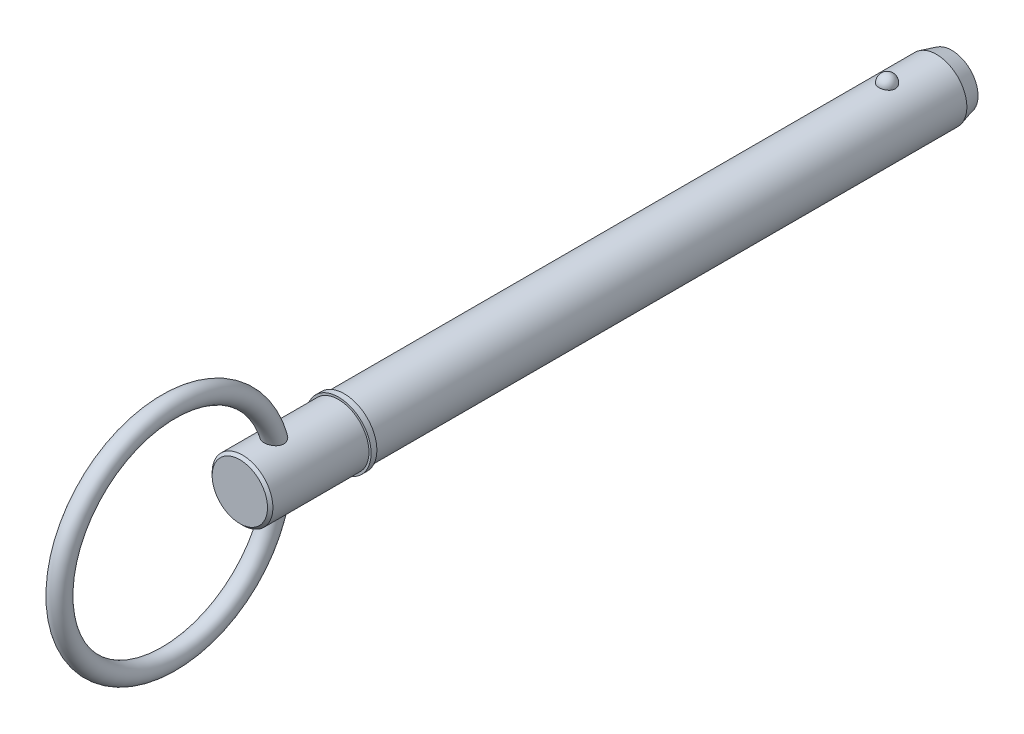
ISO-10303-21;
HEADER;
FILE_DESCRIPTION(('STEP AP214'),'2;1');
FILE_NAME('part.step','',(''),(''),'','','');
FILE_SCHEMA(('AUTOMOTIVE_DESIGN { 1 0 10303 214 1 1 1 1 }'));
ENDSEC;
DATA;
#1=APPLICATION_CONTEXT('core data for automotive mechanical design processes');
#2=APPLICATION_PROTOCOL_DEFINITION('international standard','automotive_design',2000,#1);
#3=PRODUCT_CONTEXT('',#1,'mechanical');
#4=PRODUCT('Part','Part','',(#3));
#5=PRODUCT_RELATED_PRODUCT_CATEGORY('part','',(#4));
#6=PRODUCT_DEFINITION_FORMATION('','',#4);
#7=PRODUCT_DEFINITION_CONTEXT('part definition',#1,'design');
#8=PRODUCT_DEFINITION('design','',#6,#7);
#9=PRODUCT_DEFINITION_SHAPE('','',#8);
#10=(LENGTH_UNIT() NAMED_UNIT(*) SI_UNIT(.MILLI.,.METRE.));
#11=(NAMED_UNIT(*) PLANE_ANGLE_UNIT() SI_UNIT($,.RADIAN.));
#12=(NAMED_UNIT(*) SI_UNIT($,.STERADIAN.) SOLID_ANGLE_UNIT());
#13=UNCERTAINTY_MEASURE_WITH_UNIT(LENGTH_MEASURE(1.E-05),#10,'distance_accuracy_value','');
#14=(GEOMETRIC_REPRESENTATION_CONTEXT(3) GLOBAL_UNCERTAINTY_ASSIGNED_CONTEXT((#13)) GLOBAL_UNIT_ASSIGNED_CONTEXT((#10,
#11,#12)) REPRESENTATION_CONTEXT('',''));
#15=CARTESIAN_POINT('',(0.,0.,0.));
#16=DIRECTION('',(0.,0.,1.));
#17=DIRECTION('',(1.,0.,0.));
#18=AXIS2_PLACEMENT_3D('',#15,#16,#17);
#19=CARTESIAN_POINT('',(0.,0.,139.7));
#20=DIRECTION('',(0.,0.,-1.));
#21=DIRECTION('',(-1.,0.,0.));
#22=AXIS2_PLACEMENT_3D('',#19,#20,#21);
#23=CYLINDRICAL_SURFACE('',#22,7.94);
#24=CARTESIAN_POINT('',(2.13020349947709,7.64891057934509,-2.14999999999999));
#25=CARTESIAN_POINT('',(2.1302012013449,7.64891247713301,-2.02978166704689));
#26=CARTESIAN_POINT('',(2.12037546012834,7.65166842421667,-1.90953383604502));
#27=CARTESIAN_POINT('',(2.08130792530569,7.66238579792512,-1.67243962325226));
#28=CARTESIAN_POINT('',(2.05205785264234,7.67034944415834,-1.55559471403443));
#29=CARTESIAN_POINT('',(1.97489181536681,7.69057749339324,-1.32869361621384));
#30=CARTESIAN_POINT('',(1.92698409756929,7.70283999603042,-1.21863445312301));
#31=CARTESIAN_POINT('',(1.81370645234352,7.73029430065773,-1.00831338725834));
#32=CARTESIAN_POINT('',(1.74833715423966,7.7454859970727,-0.908051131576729));
#33=CARTESIAN_POINT('',(1.60144242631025,7.77718699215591,-0.719628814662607));
#34=CARTESIAN_POINT('',(1.51984382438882,7.7937020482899,-0.631526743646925));
#35=CARTESIAN_POINT('',(1.34279837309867,7.82614685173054,-0.470411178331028));
#36=CARTESIAN_POINT('',(1.24735148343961,7.84207659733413,-0.397397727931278));
#37=CARTESIAN_POINT('',(1.04544839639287,7.87153116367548,-0.268681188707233));
#38=CARTESIAN_POINT('',(0.939022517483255,7.88506234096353,-0.212932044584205));
#39=CARTESIAN_POINT('',(0.717931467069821,7.90825597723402,-0.120080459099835));
#40=CARTESIAN_POINT('',(0.603267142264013,7.9179188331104,-0.0829761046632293));
#41=CARTESIAN_POINT('',(0.371015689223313,7.93216561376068,-0.0289596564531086));
#42=CARTESIAN_POINT('',(0.253510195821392,7.93683225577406,-0.0117183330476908));
#43=CARTESIAN_POINT('',(0.0171784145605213,7.94086051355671,0.00318921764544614));
#44=CARTESIAN_POINT('',(-0.101647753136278,7.94022260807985,0.000857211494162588));
#45=CARTESIAN_POINT('',(-0.335567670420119,7.93375751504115,-0.023146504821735));
#46=CARTESIAN_POINT('',(-0.450690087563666,7.92799987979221,-0.0445590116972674));
#47=CARTESIAN_POINT('',(-0.675610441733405,7.91200792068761,-0.10576054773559));
#48=CARTESIAN_POINT('',(-0.785408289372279,7.90177352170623,-0.145549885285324));
#49=CARTESIAN_POINT('',(-0.9972706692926,7.87784802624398,-0.242675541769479));
#50=CARTESIAN_POINT('',(-1.0992893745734,7.86413823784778,-0.300107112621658));
#51=CARTESIAN_POINT('',(-1.29223659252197,7.83474718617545,-0.430887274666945));
#52=CARTESIAN_POINT('',(-1.38316404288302,7.81906573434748,-0.504237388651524));
#53=CARTESIAN_POINT('',(-1.55313516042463,7.78710451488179,-0.666358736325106));
#54=CARTESIAN_POINT('',(-1.63193689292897,7.77081906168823,-0.755382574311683));
#55=CARTESIAN_POINT('',(-1.77366356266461,7.73970270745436,-0.945507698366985));
#56=CARTESIAN_POINT('',(-1.83658745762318,7.72487190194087,-1.04660977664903));
#57=CARTESIAN_POINT('',(-1.94556640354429,7.6981535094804,-1.25927689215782));
#58=CARTESIAN_POINT('',(-1.99143480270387,7.6862989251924,-1.3709418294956));
#59=CARTESIAN_POINT('',(-2.06418311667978,7.66708387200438,-1.60066153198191));
#60=CARTESIAN_POINT('',(-2.0910635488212,7.65972328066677,-1.71871612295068));
#61=CARTESIAN_POINT('',(-2.12508507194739,7.65035479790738,-1.9573607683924));
#62=CARTESIAN_POINT('',(-2.13230490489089,7.64832555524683,-2.07793875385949));
#63=CARTESIAN_POINT('',(-2.12704767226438,7.64978921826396,-2.31862835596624));
#64=CARTESIAN_POINT('',(-2.1145710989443,7.6532819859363,-2.43873998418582));
#65=CARTESIAN_POINT('',(-2.07034166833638,7.66536368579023,-2.67451689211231));
#66=CARTESIAN_POINT('',(-2.03867758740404,7.67392914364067,-2.79020005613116));
#67=CARTESIAN_POINT('',(-1.95694065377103,7.69517736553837,-3.01446692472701));
#68=CARTESIAN_POINT('',(-1.90686710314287,7.70786028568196,-3.12305035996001));
#69=CARTESIAN_POINT('',(-1.78925555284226,7.73600831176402,-3.33065971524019));
#70=CARTESIAN_POINT('',(-1.72162904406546,7.75148739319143,-3.42963360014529));
#71=CARTESIAN_POINT('',(-1.57074739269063,7.78346215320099,-3.61466914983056));
#72=CARTESIAN_POINT('',(-1.48749169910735,7.79995786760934,-3.70073035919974));
#73=CARTESIAN_POINT('',(-1.30720250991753,7.83219119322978,-3.8578359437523));
#74=CARTESIAN_POINT('',(-1.2101234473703,7.84792605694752,-3.92882863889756));
#75=CARTESIAN_POINT('',(-1.00503150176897,7.87681523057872,-4.05342383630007));
#76=CARTESIAN_POINT('',(-0.897019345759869,7.88996971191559,-4.10702749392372));
#77=CARTESIAN_POINT('',(-0.674439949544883,7.91208451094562,-4.19477736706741));
#78=CARTESIAN_POINT('',(-0.55996501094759,7.92109245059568,-4.22914554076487));
#79=CARTESIAN_POINT('',(-0.326625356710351,7.93413878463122,-4.27838865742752));
#80=CARTESIAN_POINT('',(-0.20776113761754,7.93817773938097,-4.29326579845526));
#81=CARTESIAN_POINT('',(0.0287357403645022,7.94081322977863,-4.3030062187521));
#82=CARTESIAN_POINT('',(0.14635312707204,7.93950453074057,-4.29821797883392));
#83=CARTESIAN_POINT('',(0.379062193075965,7.93180098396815,-4.26955229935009));
#84=CARTESIAN_POINT('',(0.494153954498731,7.92540630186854,-4.24567548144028));
#85=CARTESIAN_POINT('',(0.718185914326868,7.90824874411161,-4.17962260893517));
#86=CARTESIAN_POINT('',(0.827145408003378,7.89750055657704,-4.13750805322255));
#87=CARTESIAN_POINT('',(1.03638036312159,7.87277755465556,-4.03615078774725));
#88=CARTESIAN_POINT('',(1.13665531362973,7.85880255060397,-3.97690707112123));
#89=CARTESIAN_POINT('',(1.32729731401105,7.82887859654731,-3.84189297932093));
#90=CARTESIAN_POINT('',(1.41749828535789,7.81290379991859,-3.76589388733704));
#91=CARTESIAN_POINT('',(1.58397257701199,7.78086330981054,-3.59992466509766));
#92=CARTESIAN_POINT('',(1.66024342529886,7.76479760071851,-3.50995206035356));
#93=CARTESIAN_POINT('',(1.79805631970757,7.73405928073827,-3.3168832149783));
#94=CARTESIAN_POINT('',(1.85933944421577,7.719413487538,-3.213597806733));
#95=CARTESIAN_POINT('',(1.96397499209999,7.69345992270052,-2.99796163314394));
#96=CARTESIAN_POINT('',(2.00733488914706,7.68215076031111,-2.88561466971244));
#97=CARTESIAN_POINT('',(2.07068045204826,7.66529896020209,-2.6699413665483));
#98=CARTESIAN_POINT('',(2.09296296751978,7.65919990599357,-2.56732606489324));
#99=CARTESIAN_POINT('',(2.12272535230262,7.65100492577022,-2.35981463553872));
#100=CARTESIAN_POINT('',(2.13020550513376,7.64890892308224,-2.25491855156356));
#101=CARTESIAN_POINT('',(2.13020349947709,7.64891057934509,-2.14999999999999));
#102=B_SPLINE_CURVE_WITH_KNOTS('',3,(#24,#25,#26,#27,#28,#29,#30,#31,#32,#33,#34,#35,#36,#37,
#38,#39,#40,#41,#42,#43,#44,#45,#46,#47,#48,#49,#50,#51,#52,#53,#54,#55,#56,#57,#58,#59,#60,#61,
#62,#63,#64,#65,#66,#67,#68,#69,#70,#71,#72,#73,#74,#75,#76,#77,#78,#79,#80,#81,#82,#83,#84,#85,
#86,#87,#88,#89,#90,#91,#92,#93,#94,#95,#96,#97,#98,#99,#100,#101),.UNSPECIFIED.,.T.,.F.,(4,2,2,
2,2,2,2,2,2,2,2,2,2,2,2,2,2,2,2,2,2,2,2,2,2,2,2,2,2,2,2,2,2,2,2,2,2,2,4),(0.,0.360277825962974,
0.720709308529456,1.0809816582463,1.44124102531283,1.80316307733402,2.16508618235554,
2.52603531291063,2.88694740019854,3.24178717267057,3.59659491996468,3.94665496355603,
4.29672088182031,4.64871108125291,5.0007349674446,5.3590619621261,5.71741247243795,
6.079576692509,6.44173104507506,6.80243279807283,7.16312553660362,7.52216203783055,
7.88121215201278,8.24210915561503,8.60301888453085,8.96514709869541,9.32725124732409,
9.68508606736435,10.0428805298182,10.3943622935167,10.7458326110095,11.0961268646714,
11.4464417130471,11.8018724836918,12.1573662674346,12.5186252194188,12.8797333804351,
13.1941658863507,13.5085923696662),.UNSPECIFIED.);
#103=CARTESIAN_POINT('',(2.13020349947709,7.64891057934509,-2.14999999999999));
#104=VERTEX_POINT('',#103);
#105=EDGE_CURVE('E102',#104,#104,#102,.T.);
#106=ORIENTED_EDGE('',*,*,#105,.T.);
#107=EDGE_LOOP('',(#106));
#108=FACE_BOUND('',#107,.T.);
#109=CARTESIAN_POINT('',(0.,0.,-15.05));
#110=DIRECTION('',(0.,0.,-1.));
#111=DIRECTION('',(-1.,0.,0.));
#112=AXIS2_PLACEMENT_3D('',#109,#110,#111);
#113=CIRCLE('',#112,7.94);
#114=CARTESIAN_POINT('',(-7.94,0.,-15.05));
#115=VERTEX_POINT('',#114);
#116=EDGE_CURVE('E109',#115,#115,#113,.F.);
#117=ORIENTED_EDGE('',*,*,#116,.T.);
#118=EDGE_LOOP('',(#117));
#119=FACE_BOUND('',#118,.T.);
#120=CARTESIAN_POINT('',(0.,0.,139.7));
#121=DIRECTION('',(0.,0.,1.));
#122=DIRECTION('',(1.,0.,0.));
#123=AXIS2_PLACEMENT_3D('',#120,#121,#122);
#124=CIRCLE('',#123,7.94);
#125=CARTESIAN_POINT('',(7.94,0.,139.7));
#126=VERTEX_POINT('',#125);
#127=EDGE_CURVE('E107',#126,#126,#124,.T.);
#128=ORIENTED_EDGE('',*,*,#127,.F.);
#129=EDGE_LOOP('',(#128));
#130=FACE_BOUND('',#129,.T.);
#131=ADVANCED_FACE('F39',(#108,#119,#130),#23,.T.);
#132=CARTESIAN_POINT('',(0.,0.,-19.05));
#133=DIRECTION('',(0.,0.,-1.));
#134=DIRECTION('',(-1.,0.,0.));
#135=AXIS2_PLACEMENT_3D('',#132,#133,#134);
#136=PLANE('',#135);
#137=CARTESIAN_POINT('',(0.,0.,-19.05));
#138=DIRECTION('',(0.,0.,-1.));
#139=DIRECTION('',(-1.,0.,0.));
#140=AXIS2_PLACEMENT_3D('',#137,#138,#139);
#141=CIRCLE('',#140,6.86820323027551);
#142=CARTESIAN_POINT('',(-6.86820323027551,0.,-19.05));
#143=VERTEX_POINT('',#142);
#144=EDGE_CURVE('E141',#143,#143,#141,.T.);
#145=ORIENTED_EDGE('',*,*,#144,.T.);
#146=EDGE_LOOP('',(#145));
#147=FACE_BOUND('',#146,.T.);
#148=ADVANCED_FACE('F88',(#147),#136,.T.);
#149=CARTESIAN_POINT('',(0.,0.,-19.05));
#150=DIRECTION('',(0.,0.,1.));
#151=DIRECTION('',(1.,0.,0.));
#152=AXIS2_PLACEMENT_3D('',#149,#150,#151);
#153=CONICAL_SURFACE('',#152,6.8682032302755,0.261799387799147);
#154=ORIENTED_EDGE('',*,*,#116,.F.);
#155=EDGE_LOOP('',(#154));
#156=FACE_BOUND('',#155,.T.);
#157=ORIENTED_EDGE('',*,*,#144,.F.);
#158=EDGE_LOOP('',(#157));
#159=FACE_BOUND('',#158,.T.);
#160=ADVANCED_FACE('F94',(#156,#159),#153,.T.);
#161=CARTESIAN_POINT('',(0.,7.94,-2.14999999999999));
#162=DIRECTION('',(0.,1.,0.));
#163=DIRECTION('',(0.,0.,1.));
#164=AXIS2_PLACEMENT_3D('',#161,#162,#163);
#165=SPHERICAL_SURFACE('',#164,2.15);
#166=ORIENTED_EDGE('',*,*,#105,.F.);
#167=EDGE_LOOP('',(#166));
#168=FACE_BOUND('',#167,.T.);
#169=ADVANCED_FACE('F112',(#168),#165,.T.);
#170=CARTESIAN_POINT('',(0.,0.,139.7));
#171=DIRECTION('',(0.,0.,-1.));
#172=DIRECTION('',(-1.,0.,0.));
#173=AXIS2_PLACEMENT_3D('',#170,#171,#172);
#174=PLANE('',#173);
#175=ORIENTED_EDGE('',*,*,#127,.T.);
#176=EDGE_LOOP('',(#175));
#177=FACE_BOUND('',#176,.T.);
#178=CARTESIAN_POINT('',(0.,0.,139.7));
#179=DIRECTION('',(0.,0.,-1.));
#180=DIRECTION('',(-1.,0.,0.));
#181=AXIS2_PLACEMENT_3D('',#178,#179,#180);
#182=CIRCLE('',#181,8.5);
#183=CARTESIAN_POINT('',(-8.5,0.,139.7));
#184=VERTEX_POINT('',#183);
#185=EDGE_CURVE('E108',#184,#184,#182,.T.);
#186=ORIENTED_EDGE('',*,*,#185,.T.);
#187=EDGE_LOOP('',(#186));
#188=FACE_BOUND('',#187,.T.);
#189=ADVANCED_FACE('F116',(#177,#188),#174,.T.);
#190=CARTESIAN_POINT('',(0.,0.,33.7287874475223));
#191=DIRECTION('',(0.,0.,-1.));
#192=DIRECTION('',(-1.,0.,0.));
#193=AXIS2_PLACEMENT_3D('',#190,#191,#192);
#194=CYLINDRICAL_SURFACE('',#193,8.5);
#195=CARTESIAN_POINT('',(0.,0.,141.2));
#196=DIRECTION('',(0.,0.,-1.));
#197=DIRECTION('',(-1.,0.,0.));
#198=AXIS2_PLACEMENT_3D('',#195,#196,#197);
#199=CIRCLE('',#198,8.5);
#200=CARTESIAN_POINT('',(-8.5,0.,141.2));
#201=VERTEX_POINT('',#200);
#202=EDGE_CURVE('E133',#201,#201,#199,.T.);
#203=ORIENTED_EDGE('',*,*,#202,.T.);
#204=EDGE_LOOP('',(#203));
#205=FACE_BOUND('',#204,.T.);
#206=ORIENTED_EDGE('',*,*,#185,.F.);
#207=EDGE_LOOP('',(#206));
#208=FACE_BOUND('',#207,.T.);
#209=ADVANCED_FACE('F120',(#205,#208),#194,.T.);
#210=CARTESIAN_POINT('',(0.,8.5,141.2));
#211=DIRECTION('',(0.,0.,1.));
#212=DIRECTION('',(1.,0.,0.));
#213=AXIS2_PLACEMENT_3D('',#210,#211,#212);
#214=PLANE('',#213);
#215=CARTESIAN_POINT('',(0.,0.,141.2));
#216=DIRECTION('',(0.,0.,1.));
#217=DIRECTION('',(1.,0.,0.));
#218=AXIS2_PLACEMENT_3D('',#215,#216,#217);
#219=CIRCLE('',#218,7.94);
#220=CARTESIAN_POINT('',(7.94,0.,141.2));
#221=VERTEX_POINT('',#220);
#222=EDGE_CURVE('E111',#221,#221,#219,.T.);
#223=ORIENTED_EDGE('',*,*,#222,.F.);
#224=EDGE_LOOP('',(#223));
#225=FACE_BOUND('',#224,.T.);
#226=ORIENTED_EDGE('',*,*,#202,.F.);
#227=EDGE_LOOP('',(#226));
#228=FACE_BOUND('',#227,.T.);
#229=ADVANCED_FACE('F85',(#225,#228),#214,.T.);
#230=CARTESIAN_POINT('',(0.,0.,167.01));
#231=DIRECTION('',(0.,0.,-1.));
#232=DIRECTION('',(-1.,0.,0.));
#233=AXIS2_PLACEMENT_3D('',#230,#231,#232);
#234=CYLINDRICAL_SURFACE('',#233,7.94);
#235=CARTESIAN_POINT('',(-1.15544091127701,-7.85547938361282,155.811910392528));
#236=CARTESIAN_POINT('',(-1.03089695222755,-7.87379554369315,155.749615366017));
#237=CARTESIAN_POINT('',(-0.900845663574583,-7.8898743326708,155.697593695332));
#238=CARTESIAN_POINT('',(-0.633417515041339,-7.91583465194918,155.615265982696));
#239=CARTESIAN_POINT('',(-0.496037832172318,-7.92571377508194,155.584968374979));
#240=CARTESIAN_POINT('',(-0.217881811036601,-7.93823020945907,155.546773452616));
#241=CARTESIAN_POINT('',(-0.0771057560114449,-7.94086812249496,155.538874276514));
#242=CARTESIAN_POINT('',(0.203828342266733,-7.93862624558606,155.545648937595));
#243=CARTESIAN_POINT('',(0.343986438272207,-7.93374711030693,155.560320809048));
#244=CARTESIAN_POINT('',(0.619544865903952,-7.9169944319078,155.611877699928));
#245=CARTESIAN_POINT('',(0.754950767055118,-7.9051293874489,155.648735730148));
#246=CARTESIAN_POINT('',(1.01737529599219,-7.8756583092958,155.743842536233));
#247=CARTESIAN_POINT('',(1.14439334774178,-7.85805188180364,155.802092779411));
#248=CARTESIAN_POINT('',(1.38668443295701,-7.81893907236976,155.938842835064));
#249=CARTESIAN_POINT('',(1.50193494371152,-7.79742542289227,156.017380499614));
#250=CARTESIAN_POINT('',(1.71711272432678,-7.75288428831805,156.192872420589));
#251=CARTESIAN_POINT('',(1.81704089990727,-7.72985689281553,156.289825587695));
#252=CARTESIAN_POINT('',(1.99787261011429,-7.68509802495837,156.49887149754));
#253=CARTESIAN_POINT('',(2.07893183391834,-7.66335713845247,156.610827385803));
#254=CARTESIAN_POINT('',(2.2207658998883,-7.62346723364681,156.847480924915));
#255=CARTESIAN_POINT('',(2.28154607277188,-7.6053172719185,156.972175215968));
#256=CARTESIAN_POINT('',(2.38011540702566,-7.57504217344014,157.227618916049));
#257=CARTESIAN_POINT('',(2.41840843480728,-7.56278621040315,157.358158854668));
#258=CARTESIAN_POINT('',(2.47363993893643,-7.54490265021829,157.624095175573));
#259=CARTESIAN_POINT('',(2.49057788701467,-7.53927521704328,157.759491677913));
#260=CARTESIAN_POINT('',(2.50351014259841,-7.53499042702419,158.03242871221));
#261=CARTESIAN_POINT('',(2.49933630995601,-7.53638902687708,158.169977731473));
#262=CARTESIAN_POINT('',(2.47072547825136,-7.54581524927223,158.442698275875));
#263=CARTESIAN_POINT('',(2.44628184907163,-7.55384504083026,158.577869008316));
#264=CARTESIAN_POINT('',(2.37589315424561,-7.57629160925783,158.853085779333));
#265=CARTESIAN_POINT('',(2.32844094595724,-7.5911515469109,158.99270896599));
#266=CARTESIAN_POINT('',(2.21332780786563,-7.62550828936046,159.262781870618));
#267=CARTESIAN_POINT('',(2.14565489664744,-7.64500784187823,159.393226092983));
#268=CARTESIAN_POINT('',(1.98438755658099,-7.68852412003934,159.653702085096));
#269=CARTESIAN_POINT('',(1.88896913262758,-7.71279219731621,159.782569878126));
#270=CARTESIAN_POINT('',(1.67743245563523,-7.7615471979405,160.022112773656));
#271=CARTESIAN_POINT('',(1.56130644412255,-7.78603420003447,160.132781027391));
#272=CARTESIAN_POINT('',(1.31168281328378,-7.83191501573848,160.330100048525));
#273=CARTESIAN_POINT('',(1.1784163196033,-7.85334315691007,160.417029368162));
#274=CARTESIAN_POINT('',(0.967442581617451,-7.88116219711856,160.526657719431));
#275=CARTESIAN_POINT('',(0.89528346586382,-7.88971376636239,160.559736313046));
#276=CARTESIAN_POINT('',(0.747777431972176,-7.90505596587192,160.618400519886));
#277=CARTESIAN_POINT('',(0.672431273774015,-7.91184701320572,160.643987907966));
#278=CARTESIAN_POINT('',(0.53057561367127,-7.92252382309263,160.683912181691));
#279=CARTESIAN_POINT('',(0.464394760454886,-7.92668987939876,160.699349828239));
#280=CARTESIAN_POINT('',(0.330815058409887,-7.9333870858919,160.724069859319));
#281=CARTESIAN_POINT('',(0.263416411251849,-7.93591850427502,160.73335325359));
#282=CARTESIAN_POINT('',(0.128041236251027,-7.93925585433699,160.745577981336));
#283=CARTESIAN_POINT('',(0.0600650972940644,-7.94006286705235,160.748523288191));
#284=CARTESIAN_POINT('',(-0.0758408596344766,-7.93992929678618,160.748033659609));
#285=CARTESIAN_POINT('',(-0.143770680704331,-7.93898884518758,160.744599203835));
#286=CARTESIAN_POINT('',(-0.330023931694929,-7.93402174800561,160.726406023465));
#287=CARTESIAN_POINT('',(-0.447720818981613,-7.92820264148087,160.705060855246));
#288=CARTESIAN_POINT('',(-0.677833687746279,-7.91185818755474,160.644093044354));
#289=CARTESIAN_POINT('',(-0.790248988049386,-7.90133223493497,160.604468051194));
#290=CARTESIAN_POINT('',(-1.01082100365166,-7.87620111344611,160.507436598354));
#291=CARTESIAN_POINT('',(-1.1187367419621,-7.86147932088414,160.449515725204));
#292=CARTESIAN_POINT('',(-1.32464461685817,-7.8294189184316,160.318755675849));
#293=CARTESIAN_POINT('',(-1.42263264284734,-7.81207923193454,160.245910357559));
#294=CARTESIAN_POINT('',(-1.62038324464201,-7.77363945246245,160.076536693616));
#295=CARTESIAN_POINT('',(-1.7184938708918,-7.75235190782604,159.978123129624));
#296=CARTESIAN_POINT('',(-1.89908721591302,-7.71010284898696,159.767783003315));
#297=CARTESIAN_POINT('',(-1.9815587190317,-7.68914157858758,159.655846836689));
#298=CARTESIAN_POINT('',(-2.13974270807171,-7.64674394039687,159.405108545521));
#299=CARTESIAN_POINT('',(-2.21304020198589,-7.62562536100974,159.264719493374));
#300=CARTESIAN_POINT('',(-2.33615659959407,-7.58881542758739,158.973266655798));
#301=CARTESIAN_POINT('',(-2.38596943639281,-7.57312547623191,158.822200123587));
#302=CARTESIAN_POINT('',(-2.46059473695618,-7.54921618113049,158.510492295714));
#303=CARTESIAN_POINT('',(-2.48494918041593,-7.54113395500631,158.349728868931));
#304=CARTESIAN_POINT('',(-2.50480773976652,-7.53456588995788,158.026244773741));
#305=CARTESIAN_POINT('',(-2.50033692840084,-7.53607171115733,157.863525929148));
#306=CARTESIAN_POINT('',(-2.46306926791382,-7.54832452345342,157.557165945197));
#307=CARTESIAN_POINT('',(-2.4329569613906,-7.55819528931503,157.413162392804));
#308=CARTESIAN_POINT('',(-2.34806892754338,-7.58499431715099,157.133304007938));
#309=CARTESIAN_POINT('',(-2.29330013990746,-7.60192059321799,156.997446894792));
#310=CARTESIAN_POINT('',(-2.16523724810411,-7.63933506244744,156.74765733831));
#311=CARTESIAN_POINT('',(-2.09353456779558,-7.65948502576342,156.632853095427));
#312=CARTESIAN_POINT('',(-1.93200913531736,-7.7018104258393,156.417268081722));
#313=CARTESIAN_POINT('',(-1.842192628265,-7.72398516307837,156.316482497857));
#314=CARTESIAN_POINT('',(-1.65746337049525,-7.76558957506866,156.14131484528));
#315=CARTESIAN_POINT('',(-1.56413624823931,-7.78505810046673,156.065259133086));
#316=CARTESIAN_POINT('',(-1.36706423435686,-7.82207051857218,155.92753576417));
#317=CARTESIAN_POINT('',(-1.26331856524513,-7.83961426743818,155.865869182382));
#318=CARTESIAN_POINT('',(-1.15544091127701,-7.85547938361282,155.811910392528));
#319=B_SPLINE_CURVE_WITH_KNOTS('',3,(#235,#236,#237,#238,#239,#240,#241,#242,#243,#244,#245,
#246,#247,#248,#249,#250,#251,#252,#253,#254,#255,#256,#257,#258,#259,#260,#261,#262,#263,#264,
#265,#266,#267,#268,#269,#270,#271,#272,#273,#274,#275,#276,#277,#278,#279,#280,#281,#282,#283,
#284,#285,#286,#287,#288,#289,#290,#291,#292,#293,#294,#295,#296,#297,#298,#299,#300,#301,#302,
#303,#304,#305,#306,#307,#308,#309,#310,#311,#312,#313,#314,#315,#316,#317,#318),.UNSPECIFIED.,
.T.,.F.,(4,2,2,2,2,2,2,2,2,2,2,2,2,2,2,2,2,2,2,2,2,2,2,2,2,2,2,2,2,2,2,2,2,2,2,2,2,2,2,2,2,4),
(0.,0.420927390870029,0.842018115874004,1.26307384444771,1.68409290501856,2.10460083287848,
2.52513760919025,2.94646475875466,3.36776699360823,3.7854589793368,4.20304108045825,
4.61086922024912,5.01870744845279,5.42979890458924,5.84102487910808,6.28383316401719,
6.72690434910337,7.21113455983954,7.6955465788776,8.17400305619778,8.41316278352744,
8.65226580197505,8.85622998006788,9.06016068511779,9.26396350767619,9.4677510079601,
9.8252104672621,10.1827159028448,10.5513335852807,10.9201032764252,11.3402098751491,
11.7606166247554,12.2377707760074,12.715048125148,13.2007716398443,13.6860727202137,
14.1260485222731,14.5659005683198,14.9745225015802,15.3830037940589,15.7475760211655,
16.1121754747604),.UNSPECIFIED.);
#320=CARTESIAN_POINT('',(-1.15544091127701,-7.85547938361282,155.811910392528));
#321=VERTEX_POINT('',#320);
#322=EDGE_CURVE('E10',#321,#321,#319,.T.);
#323=ORIENTED_EDGE('',*,*,#322,.F.);
#324=EDGE_LOOP('',(#323));
#325=FACE_BOUND('',#324,.T.);
#326=CARTESIAN_POINT('',(-1.15544091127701,7.85547938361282,155.811910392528));
#327=CARTESIAN_POINT('',(-1.278579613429,7.83736699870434,155.873507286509));
#328=CARTESIAN_POINT('',(-1.39638360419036,7.8170599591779,155.945172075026));
#329=CARTESIAN_POINT('',(-1.61803025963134,7.77421032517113,156.10708252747));
#330=CARTESIAN_POINT('',(-1.72186951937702,7.7516671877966,156.197332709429));
#331=CARTESIAN_POINT('',(-1.91269683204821,7.70680387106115,156.394395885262));
#332=CARTESIAN_POINT('',(-1.99967065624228,7.68448389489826,156.501222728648));
#333=CARTESIAN_POINT('',(-2.15412555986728,7.64262858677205,156.728607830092));
#334=CARTESIAN_POINT('',(-2.22161184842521,7.62309251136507,156.849162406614));
#335=CARTESIAN_POINT('',(-2.3342927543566,7.5893410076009,157.098377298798));
#336=CARTESIAN_POINT('',(-2.3798562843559,7.57503857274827,157.226859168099));
#337=CARTESIAN_POINT('',(-2.44955571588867,7.55278941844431,157.490011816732));
#338=CARTESIAN_POINT('',(-2.47369226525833,7.544842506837,157.62468240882));
#339=CARTESIAN_POINT('',(-2.50059611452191,7.53596831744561,157.896137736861));
#340=CARTESIAN_POINT('',(-2.50339277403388,7.53503139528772,158.032919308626));
#341=CARTESIAN_POINT('',(-2.48855779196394,7.53994222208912,158.305224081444));
#342=CARTESIAN_POINT('',(-2.47092012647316,7.54579197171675,158.44074689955));
#343=CARTESIAN_POINT('',(-2.41469361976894,7.56397908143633,158.716293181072));
#344=CARTESIAN_POINT('',(-2.37479606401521,7.57671999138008,158.85602135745));
#345=CARTESIAN_POINT('',(-2.27489955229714,7.60730881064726,159.127515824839));
#346=CARTESIAN_POINT('',(-2.2148900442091,7.6251594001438,159.259277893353));
#347=CARTESIAN_POINT('',(-2.06943931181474,7.66598084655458,159.52452508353));
#348=CARTESIAN_POINT('',(-1.98208275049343,7.68928197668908,159.656914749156));
#349=CARTESIAN_POINT('',(-1.78658869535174,7.73704343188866,159.905235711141));
#350=CARTESIAN_POINT('',(-1.67843905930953,7.76150442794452,160.021157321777));
#351=CARTESIAN_POINT('',(-1.44142605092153,7.80900750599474,160.233699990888));
#352=CARTESIAN_POINT('',(-1.31231821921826,7.83202775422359,160.330058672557));
#353=CARTESIAN_POINT('',(-1.10627655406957,7.86286215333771,160.454614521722));
#354=CARTESIAN_POINT('',(-1.03552563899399,7.87252500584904,160.492805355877));
#355=CARTESIAN_POINT('',(-0.890375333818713,7.89025728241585,160.561885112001));
#356=CARTESIAN_POINT('',(-0.815978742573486,7.89832790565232,160.592779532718));
#357=CARTESIAN_POINT('',(-0.674180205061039,7.91160332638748,160.643082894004));
#358=CARTESIAN_POINT('',(-0.607145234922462,7.91704543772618,160.663468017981));
#359=CARTESIAN_POINT('',(-0.471385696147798,7.92628663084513,160.697876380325));
#360=CARTESIAN_POINT('',(-0.402662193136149,7.93008672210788,160.711903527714));
#361=CARTESIAN_POINT('',(-0.264153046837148,7.9359070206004,160.733322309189));
#362=CARTESIAN_POINT('',(-0.194368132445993,7.9379283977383,160.740718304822));
#363=CARTESIAN_POINT('',(-0.0544054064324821,7.94012285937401,160.748743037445));
#364=CARTESIAN_POINT('',(0.0157723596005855,7.94029615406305,160.749372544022));
#365=CARTESIAN_POINT('',(0.206295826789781,7.93822912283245,160.741825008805));
#366=CARTESIAN_POINT('',(0.326425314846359,7.93416340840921,160.726989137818));
#367=CARTESIAN_POINT('',(0.562310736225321,7.92094769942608,160.678077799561));
#368=CARTESIAN_POINT('',(0.67806631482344,7.91179729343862,160.64400077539));
#369=CARTESIAN_POINT('',(0.903029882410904,7.88929555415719,160.558269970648));
#370=CARTESIAN_POINT('',(1.01220356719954,7.87592415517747,160.506532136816));
#371=CARTESIAN_POINT('',(1.22142047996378,7.84620431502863,160.387793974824));
#372=CARTESIAN_POINT('',(1.32146048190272,7.82985482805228,160.320788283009));
#373=CARTESIAN_POINT('',(1.52328754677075,7.7932678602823,160.164309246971));
#374=CARTESIAN_POINT('',(1.6236508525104,7.77280069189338,160.073056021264));
#375=CARTESIAN_POINT('',(1.80985117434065,7.73156849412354,159.876815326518));
#376=CARTESIAN_POINT('',(1.895678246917,7.71080327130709,159.77181854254));
#377=CARTESIAN_POINT('',(2.06302404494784,7.66785771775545,159.534543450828));
#378=CARTESIAN_POINT('',(2.1421317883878,7.64590590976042,159.400514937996));
#379=CARTESIAN_POINT('',(2.27825755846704,7.60645646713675,159.120994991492));
#380=CARTESIAN_POINT('',(2.33526577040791,7.58896081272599,158.975498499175));
#381=CARTESIAN_POINT('',(2.42707573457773,7.56011538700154,158.670242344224));
#382=CARTESIAN_POINT('',(2.4608459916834,7.54905411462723,158.510140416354));
#383=CARTESIAN_POINT('',(2.49980168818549,7.53624914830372,158.186129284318));
#384=CARTESIAN_POINT('',(2.50500938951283,7.5344981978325,158.022223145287));
#385=CARTESIAN_POINT('',(2.48594104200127,7.54080673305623,157.709976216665));
#386=CARTESIAN_POINT('',(2.46407777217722,7.54806351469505,157.561473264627));
#387=CARTESIAN_POINT('',(2.3945479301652,7.57040718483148,157.271258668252));
#388=CARTESIAN_POINT('',(2.34689355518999,7.58549037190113,157.129543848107));
#389=CARTESIAN_POINT('',(2.2318274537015,7.62009243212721,156.869141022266));
#390=CARTESIAN_POINT('',(2.16637710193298,7.63914093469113,156.749517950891));
#391=CARTESIAN_POINT('',(2.01638736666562,7.68009146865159,156.52346099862));
#392=CARTESIAN_POINT('',(1.93184850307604,7.7019934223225,156.417026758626));
#393=CARTESIAN_POINT('',(1.746642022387,7.74608439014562,156.22066977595));
#394=CARTESIAN_POINT('',(1.646079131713,7.76827073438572,156.13064744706));
#395=CARTESIAN_POINT('',(1.43119791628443,7.81071401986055,155.968308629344));
#396=CARTESIAN_POINT('',(1.31687846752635,7.83097080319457,155.895993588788));
#397=CARTESIAN_POINT('',(1.07477437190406,7.86789551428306,155.769149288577));
#398=CARTESIAN_POINT('',(0.946739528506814,7.88446964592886,155.715069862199));
#399=CARTESIAN_POINT('',(0.683029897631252,7.91167708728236,155.628213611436));
#400=CARTESIAN_POINT('',(0.54735441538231,7.92230985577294,155.595438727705));
#401=CARTESIAN_POINT('',(0.271066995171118,7.93658630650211,155.551730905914));
#402=CARTESIAN_POINT('',(0.130424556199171,7.94017418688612,155.540972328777));
#403=CARTESIAN_POINT('',(-0.150736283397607,7.93981282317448,155.542062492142));
#404=CARTESIAN_POINT('',(-0.291254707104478,7.93586558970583,155.553905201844));
#405=CARTESIAN_POINT('',(-0.556023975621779,7.92151946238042,155.597891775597));
#406=CARTESIAN_POINT('',(-0.68062174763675,7.91171585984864,155.628166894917));
#407=CARTESIAN_POINT('',(-0.923476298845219,7.88705844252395,155.706736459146));
#408=CARTESIAN_POINT('',(-1.04173303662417,7.87220459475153,155.755031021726));
#409=CARTESIAN_POINT('',(-1.15544091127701,7.85547938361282,155.811910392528));
#410=B_SPLINE_CURVE_WITH_KNOTS('',3,(#326,#327,#328,#329,#330,#331,#332,#333,#334,#335,#336,
#337,#338,#339,#340,#341,#342,#343,#344,#345,#346,#347,#348,#349,#350,#351,#352,#353,#354,#355,
#356,#357,#358,#359,#360,#361,#362,#363,#364,#365,#366,#367,#368,#369,#370,#371,#372,#373,#374,
#375,#376,#377,#378,#379,#380,#381,#382,#383,#384,#385,#386,#387,#388,#389,#390,#391,#392,#393,
#394,#395,#396,#397,#398,#399,#400,#401,#402,#403,#404,#405,#406,#407,#408,#409),.UNSPECIFIED.,
.T.,.F.,(4,2,2,2,2,2,2,2,2,2,2,2,2,2,2,2,2,2,2,2,2,2,2,2,2,2,2,2,2,2,2,2,2,2,2,2,2,2,2,2,2,4),
(0.,0.416167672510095,0.832436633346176,1.24905527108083,1.66556244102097,2.07479168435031,
2.48400855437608,2.89266231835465,3.30143658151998,3.73725068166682,4.17329379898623,
4.65204873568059,5.13108409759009,5.61617224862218,5.85876072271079,6.10116578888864,
6.31168904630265,6.52208269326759,6.73233785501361,6.9425691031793,7.30398888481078,
7.66543791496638,8.02863174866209,8.39195337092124,8.80190673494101,9.21213940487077,
9.68159903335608,10.1512669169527,10.6406305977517,11.1296128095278,11.5779838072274,
12.0261429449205,12.4372146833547,12.8482752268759,13.256751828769,13.6652618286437,
14.0832160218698,14.5012082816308,14.9224982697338,15.3436758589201,15.72796797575,
16.1122626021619),.UNSPECIFIED.);
#411=CARTESIAN_POINT('',(-1.15544091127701,7.85547938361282,155.811910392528));
#412=VERTEX_POINT('',#411);
#413=EDGE_CURVE('E51',#412,#412,#410,.T.);
#414=ORIENTED_EDGE('',*,*,#413,.F.);
#415=EDGE_LOOP('',(#414));
#416=FACE_BOUND('',#415,.T.);
#417=CARTESIAN_POINT('',(0.,0.,166.31));
#418=DIRECTION('',(0.,0.,-1.));
#419=DIRECTION('',(-1.,0.,0.));
#420=AXIS2_PLACEMENT_3D('',#417,#418,#419);
#421=CIRCLE('',#420,7.94);
#422=CARTESIAN_POINT('',(-7.93999999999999,0.,166.31));
#423=VERTEX_POINT('',#422);
#424=EDGE_CURVE('E64',#423,#423,#421,.T.);
#425=ORIENTED_EDGE('',*,*,#424,.T.);
#426=EDGE_LOOP('',(#425));
#427=FACE_BOUND('',#426,.T.);
#428=ORIENTED_EDGE('',*,*,#222,.T.);
#429=EDGE_LOOP('',(#428));
#430=FACE_BOUND('',#429,.T.);
#431=ADVANCED_FACE('F69',(#325,#416,#427,#430),#234,.T.);
#432=CARTESIAN_POINT('',(0.,0.,167.01));
#433=DIRECTION('',(0.,0.,-1.));
#434=DIRECTION('',(-1.,0.,0.));
#435=AXIS2_PLACEMENT_3D('',#432,#433,#434);
#436=PLANE('',#435);
#437=CARTESIAN_POINT('',(0.,0.,167.01));
#438=DIRECTION('',(0.,0.,-1.));
#439=DIRECTION('',(-1.,0.,0.));
#440=AXIS2_PLACEMENT_3D('',#437,#438,#439);
#441=CIRCLE('',#440,7.24000000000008);
#442=CARTESIAN_POINT('',(-7.24000000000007,0.,167.01));
#443=VERTEX_POINT('',#442);
#444=EDGE_CURVE('E58',#443,#443,#441,.F.);
#445=ORIENTED_EDGE('',*,*,#444,.T.);
#446=EDGE_LOOP('',(#445));
#447=FACE_BOUND('',#446,.T.);
#448=ADVANCED_FACE('F76',(#447),#436,.F.);
#449=CARTESIAN_POINT('',(0.,0.,166.31));
#450=DIRECTION('',(0.,0.,-1.));
#451=DIRECTION('',(-1.,0.,0.));
#452=AXIS2_PLACEMENT_3D('',#449,#450,#451);
#453=CONICAL_SURFACE('',#452,7.94,0.785398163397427);
#454=CARTESIAN_POINT('',(-7.24000000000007,0.,167.01));
#455=CARTESIAN_POINT('',(-7.24729166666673,0.,167.002708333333));
#456=CARTESIAN_POINT('',(-7.2545833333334,0.,166.995416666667));
#457=CARTESIAN_POINT('',(-7.26916666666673,0.,166.980833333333));
#458=CARTESIAN_POINT('',(-7.2764583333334,0.,166.973541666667));
#459=CARTESIAN_POINT('',(-7.29104166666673,0.,166.958958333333));
#460=CARTESIAN_POINT('',(-7.29833333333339,0.,166.951666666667));
#461=CARTESIAN_POINT('',(-7.31291666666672,0.,166.937083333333));
#462=CARTESIAN_POINT('',(-7.32020833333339,0.,166.929791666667));
#463=CARTESIAN_POINT('',(-7.33479166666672,0.,166.915208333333));
#464=CARTESIAN_POINT('',(-7.34208333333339,0.,166.907916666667));
#465=CARTESIAN_POINT('',(-7.35666666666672,0.,166.893333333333));
#466=CARTESIAN_POINT('',(-7.36395833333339,0.,166.886041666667));
#467=CARTESIAN_POINT('',(-7.37854166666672,0.,166.871458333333));
#468=CARTESIAN_POINT('',(-7.38583333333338,0.,166.864166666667));
#469=CARTESIAN_POINT('',(-7.40041666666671,0.,166.849583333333));
#470=CARTESIAN_POINT('',(-7.40770833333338,0.,166.842291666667));
#471=CARTESIAN_POINT('',(-7.42229166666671,0.,166.827708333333));
#472=CARTESIAN_POINT('',(-7.42958333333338,0.,166.820416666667));
#473=CARTESIAN_POINT('',(-7.44416666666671,0.,166.805833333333));
#474=CARTESIAN_POINT('',(-7.45145833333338,0.,166.798541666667));
#475=CARTESIAN_POINT('',(-7.46604166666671,0.,166.783958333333));
#476=CARTESIAN_POINT('',(-7.47333333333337,0.,166.776666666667));
#477=CARTESIAN_POINT('',(-7.4879166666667,0.,166.762083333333));
#478=CARTESIAN_POINT('',(-7.49520833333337,0.,166.754791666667));
#479=CARTESIAN_POINT('',(-7.5097916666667,0.,166.740208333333));
#480=CARTESIAN_POINT('',(-7.51708333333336,0.,166.732916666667));
#481=CARTESIAN_POINT('',(-7.5316666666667,0.,166.718333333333));
#482=CARTESIAN_POINT('',(-7.53895833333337,0.,166.711041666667));
#483=CARTESIAN_POINT('',(-7.5535416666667,0.,166.696458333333));
#484=CARTESIAN_POINT('',(-7.56083333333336,0.,166.689166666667));
#485=CARTESIAN_POINT('',(-7.57541666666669,0.,166.674583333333));
#486=CARTESIAN_POINT('',(-7.58270833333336,0.,166.667291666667));
#487=CARTESIAN_POINT('',(-7.59729166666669,0.,166.652708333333));
#488=CARTESIAN_POINT('',(-7.60458333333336,0.,166.645416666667));
#489=CARTESIAN_POINT('',(-7.61916666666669,0.,166.630833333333));
#490=CARTESIAN_POINT('',(-7.62645833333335,0.,166.623541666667));
#491=CARTESIAN_POINT('',(-7.64104166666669,0.,166.608958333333));
#492=CARTESIAN_POINT('',(-7.64833333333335,0.,166.601666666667));
#493=CARTESIAN_POINT('',(-7.66291666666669,0.,166.587083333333));
#494=CARTESIAN_POINT('',(-7.67020833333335,0.,166.579791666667));
#495=CARTESIAN_POINT('',(-7.68479166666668,0.,166.565208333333));
#496=CARTESIAN_POINT('',(-7.69208333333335,0.,166.557916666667));
#497=CARTESIAN_POINT('',(-7.70666666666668,0.,166.543333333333));
#498=CARTESIAN_POINT('',(-7.71395833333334,0.,166.536041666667));
#499=CARTESIAN_POINT('',(-7.72854166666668,0.,166.521458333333));
#500=CARTESIAN_POINT('',(-7.73583333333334,0.,166.514166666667));
#501=CARTESIAN_POINT('',(-7.75041666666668,0.,166.499583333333));
#502=CARTESIAN_POINT('',(-7.75770833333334,0.,166.492291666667));
#503=CARTESIAN_POINT('',(-7.77229166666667,0.,166.477708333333));
#504=CARTESIAN_POINT('',(-7.77958333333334,0.,166.470416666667));
#505=CARTESIAN_POINT('',(-7.79416666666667,0.,166.455833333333));
#506=CARTESIAN_POINT('',(-7.80145833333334,0.,166.448541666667));
#507=CARTESIAN_POINT('',(-7.81604166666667,0.,166.433958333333));
#508=CARTESIAN_POINT('',(-7.82333333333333,0.,166.426666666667));
#509=CARTESIAN_POINT('',(-7.83791666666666,0.,166.412083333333));
#510=CARTESIAN_POINT('',(-7.84520833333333,0.,166.404791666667));
#511=CARTESIAN_POINT('',(-7.85979166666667,0.,166.390208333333));
#512=CARTESIAN_POINT('',(-7.86708333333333,0.,166.382916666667));
#513=CARTESIAN_POINT('',(-7.88166666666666,0.,166.368333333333));
#514=CARTESIAN_POINT('',(-7.88895833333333,0.,166.361041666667));
#515=CARTESIAN_POINT('',(-7.90354166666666,0.,166.346458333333));
#516=CARTESIAN_POINT('',(-7.91083333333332,0.,166.339166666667));
#517=CARTESIAN_POINT('',(-7.92541666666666,0.,166.324583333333));
#518=CARTESIAN_POINT('',(-7.93270833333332,0.,166.317291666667));
#519=CARTESIAN_POINT('',(-7.93999999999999,0.,166.31));
#520=B_SPLINE_CURVE_WITH_KNOTS('',3,(#454,#455,#456,#457,#458,#459,#460,#461,#462,#463,#464,
#465,#466,#467,#468,#469,#470,#471,#472,#473,#474,#475,#476,#477,#478,#479,#480,#481,#482,#483,
#484,#485,#486,#487,#488,#489,#490,#491,#492,#493,#494,#495,#496,#497,#498,#499,#500,#501,#502,
#503,#504,#505,#506,#507,#508,#509,#510,#511,#512,#513,#514,#515,#516,#517,#518,#519),
.UNSPECIFIED.,.F.,.F.,(4,2,2,2,2,2,2,2,2,2,2,2,2,2,2,2,2,2,2,2,2,2,2,2,2,2,2,2,2,2,2,2,4),(0.,
0.030935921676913,0.0618718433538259,0.0928077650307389,0.123743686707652,0.154679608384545,
0.185615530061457,0.21655145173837,0.247487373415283,0.278423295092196,0.30935921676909,
0.340295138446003,0.371231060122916,0.402166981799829,0.433102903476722,0.464038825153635,
0.494974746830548,0.525910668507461,0.556846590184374,0.587782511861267,0.61871843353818,
0.649654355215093,0.680590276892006,0.711526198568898,0.742462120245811,0.773398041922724,
0.804333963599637,0.83526988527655,0.866205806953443,0.897141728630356,0.928077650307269,
0.959013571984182,0.989949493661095),.UNSPECIFIED.);
#521=EDGE_CURVE('BSEAM41',#443,#423,#520,.T.);
#522=ORIENTED_EDGE('',*,*,#444,.F.);
#523=ORIENTED_EDGE('',*,*,#424,.F.);
#524=ORIENTED_EDGE('',*,*,#521,.T.);
#525=ORIENTED_EDGE('',*,*,#521,.F.);
#526=EDGE_LOOP('',(#522,#524,#523,#525));
#527=FACE_BOUND('',#526,.T.);
#528=ADVANCED_FACE('F41',(#527),#453,.T.);
#529=CARTESIAN_POINT('',(0.,0.,185.585));
#530=DIRECTION('',(1.,0.,0.));
#531=DIRECTION('',(0.,0.,-1.));
#532=AXIS2_PLACEMENT_3D('',#529,#530,#531);
#533=TOROIDAL_SURFACE('',#532,28.575,2.5);
#534=ORIENTED_EDGE('',*,*,#322,.T.);
#535=EDGE_LOOP('',(#534));
#536=FACE_BOUND('',#535,.T.);
#537=ORIENTED_EDGE('',*,*,#413,.T.);
#538=EDGE_LOOP('',(#537));
#539=FACE_BOUND('',#538,.T.);
#540=ADVANCED_FACE('F73',(#536,#539),#533,.T.);
#541=CLOSED_SHELL('',(#131,#148,#160,#169,#189,#209,#229,#431,#448,#528,#540));
#542=MANIFOLD_SOLID_BREP('B2',#541);
#543=ADVANCED_BREP_SHAPE_REPRESENTATION('',(#18,#542),#14);
#544=SHAPE_DEFINITION_REPRESENTATION(#9,#543);
ENDSEC;
END-ISO-10303-21;
